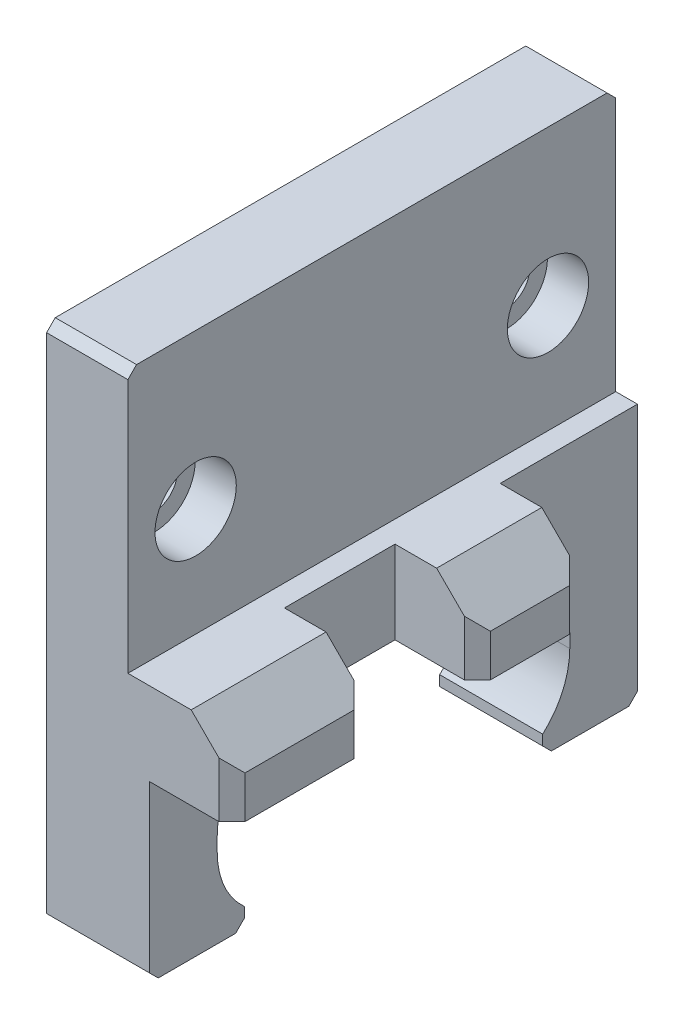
ISO-10303-21;
HEADER;
FILE_DESCRIPTION(('STEP AP214'),'2;1');
FILE_NAME('part.step','',(''),(''),'','','');
FILE_SCHEMA(('AUTOMOTIVE_DESIGN { 1 0 10303 214 1 1 1 1 }'));
ENDSEC;
DATA;
#1=APPLICATION_CONTEXT('core data for automotive mechanical design processes');
#2=APPLICATION_PROTOCOL_DEFINITION('international standard','automotive_design',2000,#1);
#3=PRODUCT_CONTEXT('',#1,'mechanical');
#4=PRODUCT('Part','Part','',(#3));
#5=PRODUCT_RELATED_PRODUCT_CATEGORY('part','',(#4));
#6=PRODUCT_DEFINITION_FORMATION('','',#4);
#7=PRODUCT_DEFINITION_CONTEXT('part definition',#1,'design');
#8=PRODUCT_DEFINITION('design','',#6,#7);
#9=PRODUCT_DEFINITION_SHAPE('','',#8);
#10=(LENGTH_UNIT() NAMED_UNIT(*) SI_UNIT(.MILLI.,.METRE.));
#11=(NAMED_UNIT(*) PLANE_ANGLE_UNIT() SI_UNIT($,.RADIAN.));
#12=(NAMED_UNIT(*) SI_UNIT($,.STERADIAN.) SOLID_ANGLE_UNIT());
#13=UNCERTAINTY_MEASURE_WITH_UNIT(LENGTH_MEASURE(1.E-05),#10,'distance_accuracy_value','');
#14=(GEOMETRIC_REPRESENTATION_CONTEXT(3) GLOBAL_UNCERTAINTY_ASSIGNED_CONTEXT((#13)) GLOBAL_UNIT_ASSIGNED_CONTEXT((#10,
#11,#12)) REPRESENTATION_CONTEXT('',''));
#15=CARTESIAN_POINT('',(0.,0.,0.));
#16=DIRECTION('',(0.,0.,1.));
#17=DIRECTION('',(1.,0.,0.));
#18=AXIS2_PLACEMENT_3D('',#15,#16,#17);
#19=CARTESIAN_POINT('',(4.57199999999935,11.1125000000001,28.5750000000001));
#20=DIRECTION('',(0.,1.00000000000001,0.));
#21=DIRECTION('',(-1.,0.,0.));
#22=AXIS2_PLACEMENT_3D('',#19,#20,#21);
#23=PLANE('',#22);
#24=DIRECTION('',(0.,0.,-1.00000000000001));
#25=VECTOR('',#24,1.);
#26=CARTESIAN_POINT('',(4.57199999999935,11.1125000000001,28.5750000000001));
#27=LINE('',#26,#25);
#28=CARTESIAN_POINT('',(4.57200000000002,11.1125000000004,-1.7018));
#29=VERTEX_POINT('',#28);
#30=CARTESIAN_POINT('',(4.57199999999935,11.1125000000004,-10.9728));
#31=VERTEX_POINT('',#30);
#32=EDGE_CURVE('E465',#29,#31,#27,.T.);
#33=ORIENTED_EDGE('',*,*,#32,.F.);
#34=DIRECTION('',(0.707106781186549,0.,-0.707106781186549));
#35=VECTOR('',#34,1.);
#36=CARTESIAN_POINT('',(4.57200000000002,11.1125000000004,-1.70180000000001));
#37=LINE('',#36,#35);
#38=CARTESIAN_POINT('',(3.048,11.1125000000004,-0.1778));
#39=VERTEX_POINT('',#38);
#40=EDGE_CURVE('E552',#29,#39,#37,.F.);
#41=ORIENTED_EDGE('',*,*,#40,.T.);
#42=DIRECTION('',(1.,0.,0.));
#43=VECTOR('',#42,1.);
#44=CARTESIAN_POINT('',(4.57200000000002,11.1125000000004,-0.177799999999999));
#45=LINE('',#44,#43);
#46=CARTESIAN_POINT('',(-5.08000000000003,11.1125000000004,-0.177800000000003));
#47=VERTEX_POINT('',#46);
#48=EDGE_CURVE('E762',#47,#39,#45,.T.);
#49=ORIENTED_EDGE('',*,*,#48,.F.);
#50=DIRECTION('',(0.,0.,-1.00000000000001));
#51=VECTOR('',#50,1.);
#52=CARTESIAN_POINT('',(-5.08000000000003,11.1125000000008,12.7762000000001));
#53=LINE('',#52,#51);
#54=CARTESIAN_POINT('',(-5.08000000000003,11.1125000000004,11.1252000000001));
#55=VERTEX_POINT('',#54);
#56=EDGE_CURVE('E759',#55,#47,#53,.T.);
#57=ORIENTED_EDGE('',*,*,#56,.F.);
#58=DIRECTION('',(1.,0.,0.));
#59=VECTOR('',#58,1.);
#60=CARTESIAN_POINT('',(-17.145,11.1125000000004,11.1252));
#61=LINE('',#60,#59);
#62=CARTESIAN_POINT('',(-17.145,11.1125000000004,11.1252));
#63=VERTEX_POINT('',#62);
#64=EDGE_CURVE('E644',#63,#55,#61,.T.);
#65=ORIENTED_EDGE('',*,*,#64,.F.);
#66=DIRECTION('',(0.,0.,1.00000000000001));
#67=VECTOR('',#66,1.);
#68=CARTESIAN_POINT('',(-17.145,11.1125000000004,11.1252));
#69=LINE('',#68,#67);
#70=CARTESIAN_POINT('',(-17.1450000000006,11.1125000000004,-11.1252000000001));
#71=VERTEX_POINT('',#70);
#72=EDGE_CURVE('E621',#71,#63,#69,.T.);
#73=ORIENTED_EDGE('',*,*,#72,.F.);
#74=DIRECTION('',(1.,0.,0.));
#75=VECTOR('',#74,1.);
#76=CARTESIAN_POINT('',(-17.1450000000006,11.1125000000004,-11.1252000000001));
#77=LINE('',#76,#75);
#78=CARTESIAN_POINT('',(-5.08000000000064,11.1125000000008,-11.1252));
#79=VERTEX_POINT('',#78);
#80=EDGE_CURVE('E458',#71,#79,#77,.T.);
#81=ORIENTED_EDGE('',*,*,#80,.T.);
#82=DIRECTION('',(0.,0.,-1.00000000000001));
#83=VECTOR('',#82,1.);
#84=CARTESIAN_POINT('',(-5.08000000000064,11.1125000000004,28.5750000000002));
#85=LINE('',#84,#83);
#86=CARTESIAN_POINT('',(-5.08000000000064,11.1125000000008,-12.4968000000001));
#87=VERTEX_POINT('',#86);
#88=EDGE_CURVE('E451',#79,#87,#85,.T.);
#89=ORIENTED_EDGE('',*,*,#88,.T.);
#90=DIRECTION('',(-1.,0.,0.));
#91=VECTOR('',#90,1.);
#92=CARTESIAN_POINT('',(4.57199999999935,11.1125000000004,-12.4968000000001));
#93=LINE('',#92,#91);
#94=CARTESIAN_POINT('',(3.04799999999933,11.1125000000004,-12.4968000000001));
#95=VERTEX_POINT('',#94);
#96=EDGE_CURVE('E433',#95,#87,#93,.T.);
#97=ORIENTED_EDGE('',*,*,#96,.F.);
#98=DIRECTION('',(-0.707106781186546,0.,-0.707106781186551));
#99=VECTOR('',#98,1.);
#100=CARTESIAN_POINT('',(3.04799999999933,11.1125000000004,-12.4968000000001));
#101=LINE('',#100,#99);
#102=EDGE_CURVE('E550',#95,#31,#101,.F.);
#103=ORIENTED_EDGE('',*,*,#102,.T.);
#104=EDGE_LOOP('',(#33,#41,#49,#57,#65,#73,#81,#89,#97,#103));
#105=FACE_BOUND('',#104,.T.);
#106=ADVANCED_FACE('F206',(#105),#23,.F.);
#107=CARTESIAN_POINT('',(4.57199999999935,20.8280000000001,28.5750000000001));
#108=DIRECTION('',(-1.,0.,0.));
#109=DIRECTION('',(0.,-1.00000000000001,0.));
#110=AXIS2_PLACEMENT_3D('',#107,#108,#109);
#111=PLANE('',#110);
#112=DIRECTION('',(0.,1.00000000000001,0.));
#113=VECTOR('',#112,1.);
#114=CARTESIAN_POINT('',(4.57199999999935,20.8280000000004,-10.9728));
#115=LINE('',#114,#113);
#116=CARTESIAN_POINT('',(4.57199999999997,16.0528000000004,-10.9728));
#117=VERTEX_POINT('',#116);
#118=EDGE_CURVE('E546',#31,#117,#115,.T.);
#119=ORIENTED_EDGE('',*,*,#118,.T.);
#120=DIRECTION('',(0.,0.,1.00000000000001));
#121=VECTOR('',#120,1.);
#122=CARTESIAN_POINT('',(4.57199999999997,16.0528000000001,28.5750000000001));
#123=LINE('',#122,#121);
#124=CARTESIAN_POINT('',(4.57200000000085,16.0528000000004,-1.70180000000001));
#125=VERTEX_POINT('',#124);
#126=EDGE_CURVE('E228',#117,#125,#123,.T.);
#127=ORIENTED_EDGE('',*,*,#126,.T.);
#128=DIRECTION('',(0.,-1.00000000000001,0.));
#129=VECTOR('',#128,1.);
#130=CARTESIAN_POINT('',(4.57199999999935,20.8280000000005,-1.70180000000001));
#131=LINE('',#130,#129);
#132=EDGE_CURVE('E548',#125,#29,#131,.T.);
#133=ORIENTED_EDGE('',*,*,#132,.T.);
#134=ORIENTED_EDGE('',*,*,#32,.T.);
#135=EDGE_LOOP('',(#119,#127,#133,#134));
#136=FACE_BOUND('',#135,.T.);
#137=ADVANCED_FACE('F583',(#136),#111,.F.);
#138=CARTESIAN_POINT('',(-5.07999999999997,-9.3217999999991,28.5750000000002));
#139=DIRECTION('',(0.,1.00000000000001,0.));
#140=DIRECTION('',(-1.,0.,0.));
#141=AXIS2_PLACEMENT_3D('',#138,#139,#140);
#142=PLANE('',#141);
#143=DIRECTION('',(0.,0.,-1.00000000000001));
#144=VECTOR('',#143,1.);
#145=CARTESIAN_POINT('',(-17.145,-9.3217999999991,28.5750000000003));
#146=LINE('',#145,#144);
#147=CARTESIAN_POINT('',(-17.145,-9.32180000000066,27.5590000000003));
#148=VERTEX_POINT('',#147);
#149=CARTESIAN_POINT('',(-17.1450000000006,-9.32179999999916,18.4912000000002));
#150=VERTEX_POINT('',#149);
#151=EDGE_CURVE('E703',#148,#150,#146,.T.);
#152=ORIENTED_EDGE('',*,*,#151,.T.);
#153=DIRECTION('',(1.,0.,0.));
#154=VECTOR('',#153,1.);
#155=CARTESIAN_POINT('',(-5.08000000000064,-9.32179999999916,18.4912000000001));
#156=LINE('',#155,#154);
#157=CARTESIAN_POINT('',(-5.08000000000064,-9.32179999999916,18.4912000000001));
#158=VERTEX_POINT('',#157);
#159=EDGE_CURVE('E504',#150,#158,#156,.T.);
#160=ORIENTED_EDGE('',*,*,#159,.T.);
#161=DIRECTION('',(0.,0.,-1.00000000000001));
#162=VECTOR('',#161,1.);
#163=CARTESIAN_POINT('',(-5.07999999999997,-9.3217999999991,28.5750000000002));
#164=LINE('',#163,#162);
#165=CARTESIAN_POINT('',(-5.07999999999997,-9.32180000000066,27.5590000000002));
#166=VERTEX_POINT('',#165);
#167=EDGE_CURVE('E470',#166,#158,#164,.T.);
#168=ORIENTED_EDGE('',*,*,#167,.F.);
#169=DIRECTION('',(-1.,0.,0.));
#170=VECTOR('',#169,1.);
#171=CARTESIAN_POINT('',(-17.145,-9.32180000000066,27.5590000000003));
#172=LINE('',#171,#170);
#173=EDGE_CURVE('E502',#166,#148,#172,.T.);
#174=ORIENTED_EDGE('',*,*,#173,.T.);
#175=EDGE_LOOP('',(#152,#160,#168,#174));
#176=FACE_BOUND('',#175,.T.);
#177=ADVANCED_FACE('F786',(#176),#142,.F.);
#178=CARTESIAN_POINT('',(-5.08000000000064,11.1125000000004,28.5750000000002));
#179=DIRECTION('',(-1.,0.,0.));
#180=DIRECTION('',(0.,-1.00000000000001,0.));
#181=AXIS2_PLACEMENT_3D('',#178,#179,#180);
#182=PLANE('',#181);
#183=ORIENTED_EDGE('',*,*,#167,.T.);
#184=DIRECTION('',(0.,-0.707106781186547,0.707106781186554));
#185=VECTOR('',#184,1.);
#186=CARTESIAN_POINT('',(-5.08000000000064,-9.32179999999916,18.4912000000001));
#187=LINE('',#186,#185);
#188=CARTESIAN_POINT('',(-5.08000000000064,-8.30579999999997,17.4752000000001));
#189=VERTEX_POINT('',#188);
#190=EDGE_CURVE('E509',#158,#189,#187,.F.);
#191=ORIENTED_EDGE('',*,*,#190,.T.);
#192=DIRECTION('',(0.,1.00000000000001,0.));
#193=VECTOR('',#192,1.);
#194=CARTESIAN_POINT('',(-5.07999999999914,11.1125000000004,17.4752000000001));
#195=LINE('',#194,#193);
#196=CARTESIAN_POINT('',(-5.07999999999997,-7.09951582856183,17.4752));
#197=VERTEX_POINT('',#196);
#198=EDGE_CURVE('E675',#189,#197,#195,.T.);
#199=ORIENTED_EDGE('',*,*,#198,.T.);
#200=CARTESIAN_POINT('',(-5.08000000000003,-6.66133814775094E-13,11.1252000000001));
#201=DIRECTION('',(-1.,0.,0.));
#202=DIRECTION('',(0.,-1.00000000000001,0.));
#203=AXIS2_PLACEMENT_3D('',#200,#201,#202);
#204=CIRCLE('',#203,9.525);
#205=CARTESIAN_POINT('',(-5.08000000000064,8.88178419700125E-13,20.6502000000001));
#206=VERTEX_POINT('',#205);
#207=EDGE_CURVE('E672',#197,#206,#204,.T.);
#208=ORIENTED_EDGE('',*,*,#207,.T.);
#209=DIRECTION('',(0.,1.00000000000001,0.));
#210=VECTOR('',#209,1.);
#211=CARTESIAN_POINT('',(-5.08000000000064,11.1125000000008,20.6502000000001));
#212=LINE('',#211,#210);
#213=CARTESIAN_POINT('',(-5.08000000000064,1.58750000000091,20.6502000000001));
#214=VERTEX_POINT('',#213);
#215=EDGE_CURVE('E669',#206,#214,#212,.T.);
#216=ORIENTED_EDGE('',*,*,#215,.T.);
#217=CARTESIAN_POINT('',(-5.07999999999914,1.58749999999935,11.1252));
#218=DIRECTION('',(-1.,0.,0.));
#219=DIRECTION('',(0.,-1.00000000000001,0.));
#220=AXIS2_PLACEMENT_3D('',#217,#218,#219);
#221=CIRCLE('',#220,9.525);
#222=EDGE_CURVE('E666',#214,#55,#221,.T.);
#223=ORIENTED_EDGE('',*,*,#222,.T.);
#224=ORIENTED_EDGE('',*,*,#56,.T.);
#225=DIRECTION('',(0.,-1.00000000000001,0.));
#226=VECTOR('',#225,1.);
#227=CARTESIAN_POINT('',(-5.08000000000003,51.6382000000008,-0.177800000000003));
#228=LINE('',#227,#226);
#229=CARTESIAN_POINT('',(-5.07999999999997,20.8280000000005,-0.177800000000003));
#230=VERTEX_POINT('',#229);
#231=EDGE_CURVE('E602',#230,#47,#228,.T.);
#232=ORIENTED_EDGE('',*,*,#231,.F.);
#233=DIRECTION('',(0.,0.,-1.00000000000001));
#234=VECTOR('',#233,1.);
#235=CARTESIAN_POINT('',(-5.08000000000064,20.8280000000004,28.5750000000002));
#236=LINE('',#235,#234);
#237=CARTESIAN_POINT('',(-5.08000000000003,20.8280000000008,12.7762000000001));
#238=VERTEX_POINT('',#237);
#239=EDGE_CURVE('E596',#238,#230,#236,.T.);
#240=ORIENTED_EDGE('',*,*,#239,.F.);
#241=DIRECTION('',(0.,-1.00000000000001,0.));
#242=VECTOR('',#241,1.);
#243=CARTESIAN_POINT('',(-5.08000000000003,51.6382000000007,12.7762000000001));
#244=LINE('',#243,#242);
#245=CARTESIAN_POINT('',(-5.08000000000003,11.1125000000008,12.7762000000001));
#246=VERTEX_POINT('',#245);
#247=EDGE_CURVE('E607',#238,#246,#244,.T.);
#248=ORIENTED_EDGE('',*,*,#247,.T.);
#249=CARTESIAN_POINT('',(-5.08000000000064,11.1125000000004,28.5750000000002));
#250=VERTEX_POINT('',#249);
#251=EDGE_CURVE('E459',#250,#246,#85,.T.);
#252=ORIENTED_EDGE('',*,*,#251,.F.);
#253=DIRECTION('',(0.,1.00000000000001,0.));
#254=VECTOR('',#253,1.);
#255=CARTESIAN_POINT('',(-5.08000000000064,11.1125000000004,28.5750000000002));
#256=LINE('',#255,#254);
#257=CARTESIAN_POINT('',(-5.07999999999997,-8.30579999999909,28.5750000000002));
#258=VERTEX_POINT('',#257);
#259=EDGE_CURVE('E687',#258,#250,#256,.T.);
#260=ORIENTED_EDGE('',*,*,#259,.F.);
#261=DIRECTION('',(0.,-0.707106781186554,-0.707106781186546));
#262=VECTOR('',#261,1.);
#263=CARTESIAN_POINT('',(-5.08000000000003,-8.30579999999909,28.5750000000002));
#264=LINE('',#263,#262);
#265=EDGE_CURVE('E507',#258,#166,#264,.T.);
#266=ORIENTED_EDGE('',*,*,#265,.T.);
#267=EDGE_LOOP('',(#183,#191,#199,#208,#216,#223,#224,#232,#240,#248,#252,#260,#266));
#268=FACE_BOUND('',#267,.T.);
#269=ADVANCED_FACE('F768',(#268),#182,.F.);
#270=CARTESIAN_POINT('',(-17.1450000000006,-9.32180000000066,-18.4912));
#271=VERTEX_POINT('',#270);
#272=CARTESIAN_POINT('',(-17.1449999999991,-9.3217999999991,-27.5590000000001));
#273=VERTEX_POINT('',#272);
#274=EDGE_CURVE('E700',#271,#273,#146,.T.);
#275=ORIENTED_EDGE('',*,*,#274,.T.);
#276=DIRECTION('',(1.,0.,0.));
#277=VECTOR('',#276,1.);
#278=CARTESIAN_POINT('',(-5.07999999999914,-9.3217999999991,-27.5590000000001));
#279=LINE('',#278,#277);
#280=CARTESIAN_POINT('',(-5.07999999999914,-9.3217999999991,-27.5590000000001));
#281=VERTEX_POINT('',#280);
#282=EDGE_CURVE('E515',#273,#281,#279,.T.);
#283=ORIENTED_EDGE('',*,*,#282,.T.);
#284=CARTESIAN_POINT('',(-5.08000000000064,-9.32180000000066,-18.4912));
#285=VERTEX_POINT('',#284);
#286=EDGE_CURVE('E463',#285,#281,#164,.T.);
#287=ORIENTED_EDGE('',*,*,#286,.F.);
#288=DIRECTION('',(-1.,0.,0.));
#289=VECTOR('',#288,1.);
#290=CARTESIAN_POINT('',(-5.08000000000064,-9.32180000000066,-18.4912));
#291=LINE('',#290,#289);
#292=EDGE_CURVE('E513',#285,#271,#291,.T.);
#293=ORIENTED_EDGE('',*,*,#292,.T.);
#294=EDGE_LOOP('',(#275,#283,#287,#293));
#295=FACE_BOUND('',#294,.T.);
#296=ADVANCED_FACE('F208',(#295),#142,.F.);
#297=ORIENTED_EDGE('',*,*,#286,.T.);
#298=DIRECTION('',(0.,-0.707106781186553,0.707106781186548));
#299=VECTOR('',#298,1.);
#300=CARTESIAN_POINT('',(-5.07999999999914,-9.3217999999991,-27.5590000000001));
#301=LINE('',#300,#299);
#302=CARTESIAN_POINT('',(-5.08000000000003,-8.30580000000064,-28.5750000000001));
#303=VERTEX_POINT('',#302);
#304=EDGE_CURVE('E520',#281,#303,#301,.F.);
#305=ORIENTED_EDGE('',*,*,#304,.T.);
#306=DIRECTION('',(0.,1.00000000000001,0.));
#307=VECTOR('',#306,1.);
#308=CARTESIAN_POINT('',(-5.08000000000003,11.1125000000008,-28.5750000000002));
#309=LINE('',#308,#307);
#310=CARTESIAN_POINT('',(-5.08000000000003,20.8280000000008,-28.5750000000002));
#311=VERTEX_POINT('',#310);
#312=EDGE_CURVE('E677',#303,#311,#309,.T.);
#313=ORIENTED_EDGE('',*,*,#312,.T.);
#314=DIRECTION('',(0.,0.,-1.00000000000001));
#315=VECTOR('',#314,1.);
#316=CARTESIAN_POINT('',(-5.08000000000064,20.8280000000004,28.5750000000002));
#317=LINE('',#316,#315);
#318=CARTESIAN_POINT('',(-5.07999999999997,20.8280000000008,-12.4968000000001));
#319=VERTEX_POINT('',#318);
#320=EDGE_CURVE('E453',#319,#311,#317,.T.);
#321=ORIENTED_EDGE('',*,*,#320,.F.);
#322=DIRECTION('',(0.,-1.00000000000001,0.));
#323=VECTOR('',#322,1.);
#324=CARTESIAN_POINT('',(-5.08000000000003,51.6382000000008,-12.4968000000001));
#325=LINE('',#324,#323);
#326=EDGE_CURVE('E437',#319,#87,#325,.T.);
#327=ORIENTED_EDGE('',*,*,#326,.T.);
#328=ORIENTED_EDGE('',*,*,#88,.F.);
#329=CARTESIAN_POINT('',(-5.07999999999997,1.58750000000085,-11.1252));
#330=DIRECTION('',(-1.,0.,0.));
#331=DIRECTION('',(0.,-1.00000000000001,0.));
#332=AXIS2_PLACEMENT_3D('',#329,#330,#331);
#333=CIRCLE('',#332,9.525);
#334=CARTESIAN_POINT('',(-5.08000000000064,1.58749999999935,-20.6502000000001));
#335=VERTEX_POINT('',#334);
#336=EDGE_CURVE('E664',#79,#335,#333,.T.);
#337=ORIENTED_EDGE('',*,*,#336,.T.);
#338=DIRECTION('',(0.,-1.00000000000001,0.));
#339=VECTOR('',#338,1.);
#340=CARTESIAN_POINT('',(-5.07999999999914,11.1125000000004,-20.6502000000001));
#341=LINE('',#340,#339);
#342=CARTESIAN_POINT('',(-5.07999999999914,-6.66133814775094E-13,-20.6502000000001));
#343=VERTEX_POINT('',#342);
#344=EDGE_CURVE('E661',#335,#343,#341,.T.);
#345=ORIENTED_EDGE('',*,*,#344,.T.);
#346=CARTESIAN_POINT('',(-5.08000000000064,8.88178419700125E-13,-11.1252));
#347=DIRECTION('',(-1.,0.,0.));
#348=DIRECTION('',(0.,-1.00000000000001,0.));
#349=AXIS2_PLACEMENT_3D('',#346,#347,#348);
#350=CIRCLE('',#349,9.525);
#351=CARTESIAN_POINT('',(-5.07999999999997,-7.09951582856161,-17.4752000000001));
#352=VERTEX_POINT('',#351);
#353=EDGE_CURVE('E658',#343,#352,#350,.T.);
#354=ORIENTED_EDGE('',*,*,#353,.T.);
#355=DIRECTION('',(0.,-1.00000000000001,0.));
#356=VECTOR('',#355,1.);
#357=CARTESIAN_POINT('',(-5.08000000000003,11.1125000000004,-17.4752000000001));
#358=LINE('',#357,#356);
#359=CARTESIAN_POINT('',(-5.07999999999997,-8.30579999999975,-17.4752));
#360=VERTEX_POINT('',#359);
#361=EDGE_CURVE('E637',#352,#360,#358,.T.);
#362=ORIENTED_EDGE('',*,*,#361,.T.);
#363=DIRECTION('',(0.,0.707106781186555,0.707106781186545));
#364=VECTOR('',#363,1.);
#365=CARTESIAN_POINT('',(-5.07999999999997,-8.30579999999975,-17.4752));
#366=LINE('',#365,#364);
#367=EDGE_CURVE('E518',#360,#285,#366,.F.);
#368=ORIENTED_EDGE('',*,*,#367,.T.);
#369=EDGE_LOOP('',(#297,#305,#313,#321,#327,#328,#337,#345,#354,#362,#368));
#370=FACE_BOUND('',#369,.T.);
#371=ADVANCED_FACE('F449',(#370),#182,.F.);
#372=CARTESIAN_POINT('',(4.57199999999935,11.1125000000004,27.0510000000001));
#373=VERTEX_POINT('',#372);
#374=CARTESIAN_POINT('',(4.57199999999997,11.1125000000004,14.3002000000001));
#375=VERTEX_POINT('',#374);
#376=EDGE_CURVE('E460',#373,#375,#27,.T.);
#377=ORIENTED_EDGE('',*,*,#376,.F.);
#378=DIRECTION('',(-0.707106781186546,0.,0.707106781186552));
#379=VECTOR('',#378,1.);
#380=CARTESIAN_POINT('',(3.04799999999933,11.1124999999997,28.5750000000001));
#381=LINE('',#380,#379);
#382=CARTESIAN_POINT('',(3.04799999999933,11.1124999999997,28.5750000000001));
#383=VERTEX_POINT('',#382);
#384=EDGE_CURVE('E542',#373,#383,#381,.T.);
#385=ORIENTED_EDGE('',*,*,#384,.T.);
#386=DIRECTION('',(1.,0.,0.));
#387=VECTOR('',#386,1.);
#388=CARTESIAN_POINT('',(4.57199999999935,11.1125000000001,28.5750000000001));
#389=LINE('',#388,#387);
#390=EDGE_CURVE('E689',#250,#383,#389,.T.);
#391=ORIENTED_EDGE('',*,*,#390,.F.);
#392=ORIENTED_EDGE('',*,*,#251,.T.);
#393=DIRECTION('',(-1.,0.,0.));
#394=VECTOR('',#393,1.);
#395=CARTESIAN_POINT('',(4.57199999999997,11.1125,12.7762000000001));
#396=LINE('',#395,#394);
#397=CARTESIAN_POINT('',(3.048,11.1125,12.7762000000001));
#398=VERTEX_POINT('',#397);
#399=EDGE_CURVE('E755',#398,#246,#396,.T.);
#400=ORIENTED_EDGE('',*,*,#399,.F.);
#401=DIRECTION('',(-0.707106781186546,0.,-0.707106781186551));
#402=VECTOR('',#401,1.);
#403=CARTESIAN_POINT('',(3.048,11.1125,12.7762000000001));
#404=LINE('',#403,#402);
#405=EDGE_CURVE('E540',#398,#375,#404,.F.);
#406=ORIENTED_EDGE('',*,*,#405,.T.);
#407=EDGE_LOOP('',(#377,#385,#391,#392,#400,#406));
#408=FACE_BOUND('',#407,.T.);
#409=ADVANCED_FACE('F756',(#408),#23,.F.);
#410=DIRECTION('',(0.,1.00000000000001,0.));
#411=VECTOR('',#410,1.);
#412=CARTESIAN_POINT('',(4.57199999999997,20.8280000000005,14.3002000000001));
#413=LINE('',#412,#411);
#414=CARTESIAN_POINT('',(4.57199999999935,16.0528000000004,14.3002000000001));
#415=VERTEX_POINT('',#414);
#416=EDGE_CURVE('E535',#375,#415,#413,.T.);
#417=ORIENTED_EDGE('',*,*,#416,.T.);
#418=DIRECTION('',(0.,0.,1.00000000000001));
#419=VECTOR('',#418,1.);
#420=CARTESIAN_POINT('',(4.57199999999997,16.0528000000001,28.5750000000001));
#421=LINE('',#420,#419);
#422=CARTESIAN_POINT('',(4.57199999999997,16.0528000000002,27.0510000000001));
#423=VERTEX_POINT('',#422);
#424=EDGE_CURVE('E567',#415,#423,#421,.T.);
#425=ORIENTED_EDGE('',*,*,#424,.T.);
#426=DIRECTION('',(0.,-1.00000000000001,0.));
#427=VECTOR('',#426,1.);
#428=CARTESIAN_POINT('',(4.57199999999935,11.1125000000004,27.0510000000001));
#429=LINE('',#428,#427);
#430=EDGE_CURVE('E538',#423,#373,#429,.T.);
#431=ORIENTED_EDGE('',*,*,#430,.T.);
#432=ORIENTED_EDGE('',*,*,#376,.T.);
#433=EDGE_LOOP('',(#417,#425,#431,#432));
#434=FACE_BOUND('',#433,.T.);
#435=ADVANCED_FACE('F776',(#434),#111,.F.);
#436=CARTESIAN_POINT('',(-7.62000000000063,20.8279999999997,28.5750000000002));
#437=DIRECTION('',(0.,-1.00000000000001,0.));
#438=DIRECTION('',(0.,0.,-1.00000000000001));
#439=AXIS2_PLACEMENT_3D('',#436,#437,#438);
#440=PLANE('',#439);
#441=DIRECTION('',(-1.,0.,0.));
#442=VECTOR('',#441,1.);
#443=CARTESIAN_POINT('',(-7.62000000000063,20.8279999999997,28.5750000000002));
#444=LINE('',#443,#442);
#445=CARTESIAN_POINT('',(-0.203200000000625,20.8280000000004,28.5750000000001));
#446=VERTEX_POINT('',#445);
#447=CARTESIAN_POINT('',(-7.62000000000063,20.8279999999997,28.5750000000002));
#448=VERTEX_POINT('',#447);
#449=EDGE_CURVE('E692',#446,#448,#444,.T.);
#450=ORIENTED_EDGE('',*,*,#449,.F.);
#451=DIRECTION('',(0.,0.,-1.00000000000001));
#452=VECTOR('',#451,1.);
#453=CARTESIAN_POINT('',(-0.203200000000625,20.8280000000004,28.5750000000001));
#454=LINE('',#453,#452);
#455=CARTESIAN_POINT('',(-0.203200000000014,20.828,12.7762000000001));
#456=VERTEX_POINT('',#455);
#457=EDGE_CURVE('E560',#446,#456,#454,.T.);
#458=ORIENTED_EDGE('',*,*,#457,.T.);
#459=DIRECTION('',(-1.,0.,0.));
#460=VECTOR('',#459,1.);
#461=CARTESIAN_POINT('',(-7.62000000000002,20.828,12.7762000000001));
#462=LINE('',#461,#460);
#463=EDGE_CURVE('E525',#456,#238,#462,.T.);
#464=ORIENTED_EDGE('',*,*,#463,.T.);
#465=ORIENTED_EDGE('',*,*,#239,.T.);
#466=DIRECTION('',(1.,0.,0.));
#467=VECTOR('',#466,1.);
#468=CARTESIAN_POINT('',(-7.61999999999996,20.8280000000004,-0.177800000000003));
#469=LINE('',#468,#467);
#470=CARTESIAN_POINT('',(-0.203200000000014,20.8280000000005,-0.1778));
#471=VERTEX_POINT('',#470);
#472=EDGE_CURVE('E527',#230,#471,#469,.T.);
#473=ORIENTED_EDGE('',*,*,#472,.T.);
#474=DIRECTION('',(0.,0.,-1.00000000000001));
#475=VECTOR('',#474,1.);
#476=CARTESIAN_POINT('',(-0.203200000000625,20.8280000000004,28.5750000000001));
#477=LINE('',#476,#475);
#478=CARTESIAN_POINT('',(-0.203199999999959,20.8280000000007,-12.4968000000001));
#479=VERTEX_POINT('',#478);
#480=EDGE_CURVE('E557',#471,#479,#477,.T.);
#481=ORIENTED_EDGE('',*,*,#480,.T.);
#482=DIRECTION('',(-1.,0.,0.));
#483=VECTOR('',#482,1.);
#484=CARTESIAN_POINT('',(-7.61999999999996,20.8280000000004,-12.4968000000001));
#485=LINE('',#484,#483);
#486=EDGE_CURVE('E530',#479,#319,#485,.T.);
#487=ORIENTED_EDGE('',*,*,#486,.T.);
#488=ORIENTED_EDGE('',*,*,#320,.T.);
#489=DIRECTION('',(-1.,0.,0.));
#490=VECTOR('',#489,1.);
#491=CARTESIAN_POINT('',(-7.62000000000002,20.8280000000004,-28.5750000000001));
#492=LINE('',#491,#490);
#493=CARTESIAN_POINT('',(-7.62000000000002,20.8280000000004,-28.5750000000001));
#494=VERTEX_POINT('',#493);
#495=EDGE_CURVE('E679',#311,#494,#492,.T.);
#496=ORIENTED_EDGE('',*,*,#495,.T.);
#497=DIRECTION('',(0.,0.,-1.00000000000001));
#498=VECTOR('',#497,1.);
#499=CARTESIAN_POINT('',(-7.62000000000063,20.8279999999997,28.5750000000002));
#500=LINE('',#499,#498);
#501=EDGE_CURVE('E709',#448,#494,#500,.T.);
#502=ORIENTED_EDGE('',*,*,#501,.F.);
#503=EDGE_LOOP('',(#450,#458,#464,#465,#473,#481,#487,#488,#496,#502));
#504=FACE_BOUND('',#503,.T.);
#505=ADVANCED_FACE('F594',(#504),#440,.F.);
#506=CARTESIAN_POINT('',(-7.62000000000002,51.6382,28.5750000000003));
#507=DIRECTION('',(-1.,0.,0.));
#508=DIRECTION('',(0.,-1.00000000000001,0.));
#509=AXIS2_PLACEMENT_3D('',#506,#507,#508);
#510=PLANE('',#509);
#511=CARTESIAN_POINT('',(-7.61999999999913,33.5280000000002,-20.6375));
#512=DIRECTION('',(1.,0.,0.));
#513=DIRECTION('',(0.,0.,-1.00000000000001));
#514=AXIS2_PLACEMENT_3D('',#511,#512,#513);
#515=CIRCLE('',#514,4.76249999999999);
#516=CARTESIAN_POINT('',(-7.61999999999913,33.5280000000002,-25.4000000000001));
#517=VERTEX_POINT('',#516);
#518=EDGE_CURVE('E906',#517,#517,#515,.T.);
#519=ORIENTED_EDGE('',*,*,#518,.F.);
#520=EDGE_LOOP('',(#519));
#521=FACE_BOUND('',#520,.T.);
#522=CARTESIAN_POINT('',(-7.61999999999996,33.528,20.6375000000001));
#523=DIRECTION('',(1.,0.,0.));
#524=DIRECTION('',(0.,0.,-1.00000000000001));
#525=AXIS2_PLACEMENT_3D('',#522,#523,#524);
#526=CIRCLE('',#525,4.76249999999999);
#527=CARTESIAN_POINT('',(-7.61999999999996,33.528,15.8750000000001));
#528=VERTEX_POINT('',#527);
#529=EDGE_CURVE('E909',#528,#528,#526,.T.);
#530=ORIENTED_EDGE('',*,*,#529,.F.);
#531=EDGE_LOOP('',(#530));
#532=FACE_BOUND('',#531,.T.);
#533=DIRECTION('',(0.,1.00000000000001,0.));
#534=VECTOR('',#533,1.);
#535=CARTESIAN_POINT('',(-7.62000000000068,51.6382000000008,-28.5750000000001));
#536=LINE('',#535,#534);
#537=CARTESIAN_POINT('',(-7.62000000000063,50.6222000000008,-28.5750000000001));
#538=VERTEX_POINT('',#537);
#539=EDGE_CURVE('E681',#494,#538,#536,.T.);
#540=ORIENTED_EDGE('',*,*,#539,.T.);
#541=DIRECTION('',(0.,-0.707106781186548,-0.707106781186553));
#542=VECTOR('',#541,1.);
#543=CARTESIAN_POINT('',(-7.62000000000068,51.6382000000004,-27.5590000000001));
#544=LINE('',#543,#542);
#545=CARTESIAN_POINT('',(-7.62000000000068,51.6382000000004,-27.559));
#546=VERTEX_POINT('',#545);
#547=EDGE_CURVE('E494',#538,#546,#544,.F.);
#548=ORIENTED_EDGE('',*,*,#547,.T.);
#549=DIRECTION('',(0.,0.,-1.00000000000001));
#550=VECTOR('',#549,1.);
#551=CARTESIAN_POINT('',(-7.62000000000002,51.6382,28.5750000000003));
#552=LINE('',#551,#550);
#553=CARTESIAN_POINT('',(-7.62000000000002,51.6382,27.5590000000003));
#554=VERTEX_POINT('',#553);
#555=EDGE_CURVE('E707',#554,#546,#552,.T.);
#556=ORIENTED_EDGE('',*,*,#555,.F.);
#557=DIRECTION('',(0.,-0.707106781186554,0.707106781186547));
#558=VECTOR('',#557,1.);
#559=CARTESIAN_POINT('',(-7.62000000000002,50.6222,28.5750000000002));
#560=LINE('',#559,#558);
#561=CARTESIAN_POINT('',(-7.62000000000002,50.6222,28.5750000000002));
#562=VERTEX_POINT('',#561);
#563=EDGE_CURVE('E492',#554,#562,#560,.T.);
#564=ORIENTED_EDGE('',*,*,#563,.T.);
#565=DIRECTION('',(0.,1.00000000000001,0.));
#566=VECTOR('',#565,1.);
#567=CARTESIAN_POINT('',(-7.62000000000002,51.6382,28.5750000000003));
#568=LINE('',#567,#566);
#569=EDGE_CURVE('E694',#448,#562,#568,.T.);
#570=ORIENTED_EDGE('',*,*,#569,.F.);
#571=ORIENTED_EDGE('',*,*,#501,.T.);
#572=EDGE_LOOP('',(#540,#548,#556,#564,#570,#571));
#573=FACE_BOUND('',#572,.T.);
#574=ADVANCED_FACE('F715',(#521,#532,#573),#510,.F.);
#575=CARTESIAN_POINT('',(-17.145,51.6382000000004,28.5750000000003));
#576=DIRECTION('',(0.,-1.00000000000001,0.));
#577=DIRECTION('',(0.,0.,-1.00000000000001));
#578=AXIS2_PLACEMENT_3D('',#575,#576,#577);
#579=PLANE('',#578);
#580=ORIENTED_EDGE('',*,*,#555,.T.);
#581=DIRECTION('',(-1.,0.,0.));
#582=VECTOR('',#581,1.);
#583=CARTESIAN_POINT('',(-17.1450000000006,51.6382000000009,-27.5590000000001));
#584=LINE('',#583,#582);
#585=CARTESIAN_POINT('',(-17.1450000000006,51.6382000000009,-27.559));
#586=VERTEX_POINT('',#585);
#587=EDGE_CURVE('E473',#546,#586,#584,.T.);
#588=ORIENTED_EDGE('',*,*,#587,.T.);
#589=DIRECTION('',(0.,0.,-1.00000000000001));
#590=VECTOR('',#589,1.);
#591=CARTESIAN_POINT('',(-17.145,51.6382000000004,28.5750000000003));
#592=LINE('',#591,#590);
#593=CARTESIAN_POINT('',(-17.145,51.6382000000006,27.5590000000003));
#594=VERTEX_POINT('',#593);
#595=EDGE_CURVE('E704',#594,#586,#592,.T.);
#596=ORIENTED_EDGE('',*,*,#595,.F.);
#597=DIRECTION('',(1.,0.,0.));
#598=VECTOR('',#597,1.);
#599=CARTESIAN_POINT('',(-7.62000000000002,51.6382,27.5590000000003));
#600=LINE('',#599,#598);
#601=EDGE_CURVE('E471',#594,#554,#600,.T.);
#602=ORIENTED_EDGE('',*,*,#601,.T.);
#603=EDGE_LOOP('',(#580,#588,#596,#602));
#604=FACE_BOUND('',#603,.T.);
#605=ADVANCED_FACE('F729',(#604),#579,.F.);
#606=CARTESIAN_POINT('',(-17.145,-9.3217999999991,28.5750000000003));
#607=DIRECTION('',(1.,0.,0.));
#608=DIRECTION('',(0.,0.,-1.00000000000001));
#609=AXIS2_PLACEMENT_3D('',#606,#607,#608);
#610=PLANE('',#609);
#611=CARTESIAN_POINT('',(-17.1449999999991,33.5280000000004,-20.6375));
#612=DIRECTION('',(1.,0.,0.));
#613=DIRECTION('',(0.,0.,-1.00000000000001));
#614=AXIS2_PLACEMENT_3D('',#611,#612,#613);
#615=CIRCLE('',#614,2.667);
#616=CARTESIAN_POINT('',(-17.1449999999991,33.5280000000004,-23.3045000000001));
#617=VERTEX_POINT('',#616);
#618=EDGE_CURVE('E912',#617,#617,#615,.T.);
#619=ORIENTED_EDGE('',*,*,#618,.T.);
#620=EDGE_LOOP('',(#619));
#621=FACE_BOUND('',#620,.T.);
#622=CARTESIAN_POINT('',(-17.145,33.5280000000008,20.6375000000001));
#623=DIRECTION('',(1.,0.,0.));
#624=DIRECTION('',(0.,0.,-1.00000000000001));
#625=AXIS2_PLACEMENT_3D('',#622,#623,#624);
#626=CIRCLE('',#625,2.667);
#627=CARTESIAN_POINT('',(-17.145,33.5280000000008,17.9705000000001));
#628=VERTEX_POINT('',#627);
#629=EDGE_CURVE('E443',#628,#628,#626,.T.);
#630=ORIENTED_EDGE('',*,*,#629,.T.);
#631=EDGE_LOOP('',(#630));
#632=FACE_BOUND('',#631,.T.);
#633=ORIENTED_EDGE('',*,*,#595,.T.);
#634=DIRECTION('',(0.,0.707106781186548,0.707106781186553));
#635=VECTOR('',#634,1.);
#636=CARTESIAN_POINT('',(-17.1450000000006,51.6382000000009,-27.5590000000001));
#637=LINE('',#636,#635);
#638=CARTESIAN_POINT('',(-17.1450000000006,50.6222000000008,-28.5750000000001));
#639=VERTEX_POINT('',#638);
#640=EDGE_CURVE('E486',#586,#639,#637,.F.);
#641=ORIENTED_EDGE('',*,*,#640,.T.);
#642=DIRECTION('',(0.,-1.00000000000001,0.));
#643=VECTOR('',#642,1.);
#644=CARTESIAN_POINT('',(-17.1449999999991,-9.32180000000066,-28.5750000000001));
#645=LINE('',#644,#643);
#646=CARTESIAN_POINT('',(-17.145,-8.30580000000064,-28.5750000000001));
#647=VERTEX_POINT('',#646);
#648=EDGE_CURVE('E684',#639,#647,#645,.T.);
#649=ORIENTED_EDGE('',*,*,#648,.T.);
#650=DIRECTION('',(0.,0.707106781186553,-0.707106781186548));
#651=VECTOR('',#650,1.);
#652=CARTESIAN_POINT('',(-17.1449999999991,-9.3217999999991,-27.5590000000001));
#653=LINE('',#652,#651);
#654=EDGE_CURVE('E480',#647,#273,#653,.F.);
#655=ORIENTED_EDGE('',*,*,#654,.T.);
#656=ORIENTED_EDGE('',*,*,#274,.F.);
#657=DIRECTION('',(0.,-0.707106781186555,-0.707106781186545));
#658=VECTOR('',#657,1.);
#659=CARTESIAN_POINT('',(-17.145,-8.30579999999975,-17.4752));
#660=LINE('',#659,#658);
#661=CARTESIAN_POINT('',(-17.145,-8.30579999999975,-17.4752));
#662=VERTEX_POINT('',#661);
#663=EDGE_CURVE('E476',#271,#662,#660,.F.);
#664=ORIENTED_EDGE('',*,*,#663,.T.);
#665=DIRECTION('',(0.,1.00000000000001,0.));
#666=VECTOR('',#665,1.);
#667=CARTESIAN_POINT('',(-17.1450000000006,-9.32179999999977,-17.4752));
#668=LINE('',#667,#666);
#669=CARTESIAN_POINT('',(-17.145,-7.09951582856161,-17.4752000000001));
#670=VERTEX_POINT('',#669);
#671=EDGE_CURVE('E605',#662,#670,#668,.T.);
#672=ORIENTED_EDGE('',*,*,#671,.T.);
#673=CARTESIAN_POINT('',(-17.1450000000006,8.88178419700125E-13,-11.1252000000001));
#674=DIRECTION('',(1.,0.,0.));
#675=DIRECTION('',(0.,0.,1.00000000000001));
#676=AXIS2_PLACEMENT_3D('',#673,#674,#675);
#677=CIRCLE('',#676,9.525);
#678=CARTESIAN_POINT('',(-17.1449999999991,-6.66133814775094E-13,-20.6502));
#679=VERTEX_POINT('',#678);
#680=EDGE_CURVE('E612',#670,#679,#677,.T.);
#681=ORIENTED_EDGE('',*,*,#680,.T.);
#682=DIRECTION('',(0.,1.00000000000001,0.));
#683=VECTOR('',#682,1.);
#684=CARTESIAN_POINT('',(-17.1450000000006,1.58749999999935,-20.6502));
#685=LINE('',#684,#683);
#686=CARTESIAN_POINT('',(-17.1450000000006,1.58749999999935,-20.6502));
#687=VERTEX_POINT('',#686);
#688=EDGE_CURVE('E615',#679,#687,#685,.T.);
#689=ORIENTED_EDGE('',*,*,#688,.T.);
#690=CARTESIAN_POINT('',(-17.145,1.58750000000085,-11.1252000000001));
#691=DIRECTION('',(1.,0.,0.));
#692=DIRECTION('',(0.,0.,-1.00000000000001));
#693=AXIS2_PLACEMENT_3D('',#690,#691,#692);
#694=CIRCLE('',#693,9.525);
#695=EDGE_CURVE('E618',#687,#71,#694,.T.);
#696=ORIENTED_EDGE('',*,*,#695,.T.);
#697=ORIENTED_EDGE('',*,*,#72,.T.);
#698=CARTESIAN_POINT('',(-17.1449999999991,1.58749999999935,11.1252));
#699=DIRECTION('',(1.,0.,0.));
#700=DIRECTION('',(0.,0.,1.00000000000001));
#701=AXIS2_PLACEMENT_3D('',#698,#699,#700);
#702=CIRCLE('',#701,9.525);
#703=CARTESIAN_POINT('',(-17.1450000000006,1.58750000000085,20.6502000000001));
#704=VERTEX_POINT('',#703);
#705=EDGE_CURVE('E624',#63,#704,#702,.T.);
#706=ORIENTED_EDGE('',*,*,#705,.T.);
#707=DIRECTION('',(0.,-1.00000000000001,0.));
#708=VECTOR('',#707,1.);
#709=CARTESIAN_POINT('',(-17.1450000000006,1.58750000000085,20.6502000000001));
#710=LINE('',#709,#708);
#711=CARTESIAN_POINT('',(-17.1450000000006,8.88178419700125E-13,20.6502000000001));
#712=VERTEX_POINT('',#711);
#713=EDGE_CURVE('E627',#704,#712,#710,.T.);
#714=ORIENTED_EDGE('',*,*,#713,.T.);
#715=CARTESIAN_POINT('',(-17.145,-6.66133814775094E-13,11.1252));
#716=DIRECTION('',(1.,0.,0.));
#717=DIRECTION('',(0.,0.,-1.00000000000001));
#718=AXIS2_PLACEMENT_3D('',#715,#716,#717);
#719=CIRCLE('',#718,9.525);
#720=CARTESIAN_POINT('',(-17.145,-7.09951582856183,17.4752000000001));
#721=VERTEX_POINT('',#720);
#722=EDGE_CURVE('E630',#712,#721,#719,.T.);
#723=ORIENTED_EDGE('',*,*,#722,.T.);
#724=DIRECTION('',(0.,-1.00000000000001,0.));
#725=VECTOR('',#724,1.);
#726=CARTESIAN_POINT('',(-17.1450000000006,-9.32179999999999,17.4752000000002));
#727=LINE('',#726,#725);
#728=CARTESIAN_POINT('',(-17.1450000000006,-8.30579999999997,17.4752000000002));
#729=VERTEX_POINT('',#728);
#730=EDGE_CURVE('E601',#721,#729,#727,.T.);
#731=ORIENTED_EDGE('',*,*,#730,.T.);
#732=DIRECTION('',(0.,0.707106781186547,-0.707106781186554));
#733=VECTOR('',#732,1.);
#734=CARTESIAN_POINT('',(-17.1450000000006,-9.32179999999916,18.4912000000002));
#735=LINE('',#734,#733);
#736=EDGE_CURVE('E482',#729,#150,#735,.F.);
#737=ORIENTED_EDGE('',*,*,#736,.T.);
#738=ORIENTED_EDGE('',*,*,#151,.F.);
#739=DIRECTION('',(0.,0.707106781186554,0.707106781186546));
#740=VECTOR('',#739,1.);
#741=CARTESIAN_POINT('',(-17.145,-8.30579999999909,28.5750000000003));
#742=LINE('',#741,#740);
#743=CARTESIAN_POINT('',(-17.145,-8.30579999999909,28.5750000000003));
#744=VERTEX_POINT('',#743);
#745=EDGE_CURVE('E478',#148,#744,#742,.T.);
#746=ORIENTED_EDGE('',*,*,#745,.T.);
#747=DIRECTION('',(0.,-1.00000000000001,0.));
#748=VECTOR('',#747,1.);
#749=CARTESIAN_POINT('',(-17.145,-9.3217999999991,28.5750000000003));
#750=LINE('',#749,#748);
#751=CARTESIAN_POINT('',(-17.145,50.6222000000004,28.5750000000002));
#752=VERTEX_POINT('',#751);
#753=EDGE_CURVE('E697',#752,#744,#750,.T.);
#754=ORIENTED_EDGE('',*,*,#753,.F.);
#755=DIRECTION('',(0.,0.707106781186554,-0.707106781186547));
#756=VECTOR('',#755,1.);
#757=CARTESIAN_POINT('',(-17.145,50.6222000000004,28.5750000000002));
#758=LINE('',#757,#756);
#759=EDGE_CURVE('E484',#752,#594,#758,.T.);
#760=ORIENTED_EDGE('',*,*,#759,.T.);
#761=EDGE_LOOP('',(#633,#641,#649,#655,#656,#664,#672,#681,#689,#696,#697,#706,#714,#723,#731,
#737,#738,#746,#754,#760));
#762=FACE_BOUND('',#761,.T.);
#763=ADVANCED_FACE('F893',(#621,#632,#762),#610,.F.);
#764=CARTESIAN_POINT('',(4.57200000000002,-9.32179999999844,28.5750000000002));
#765=DIRECTION('',(0.,0.,1.00000000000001));
#766=DIRECTION('',(1.,0.,0.));
#767=AXIS2_PLACEMENT_3D('',#764,#765,#766);
#768=PLANE('',#767);
#769=DIRECTION('',(0.,1.00000000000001,0.));
#770=VECTOR('',#769,1.);
#771=CARTESIAN_POINT('',(3.04799999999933,20.8279999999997,28.5750000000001));
#772=LINE('',#771,#770);
#773=CARTESIAN_POINT('',(3.048,17.5767999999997,28.5750000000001));
#774=VERTEX_POINT('',#773);
#775=EDGE_CURVE('E532',#383,#774,#772,.T.);
#776=ORIENTED_EDGE('',*,*,#775,.T.);
#777=DIRECTION('',(0.707106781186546,-0.707106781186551,0.));
#778=VECTOR('',#777,1.);
#779=CARTESIAN_POINT('',(17.2593,3.36550000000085,28.5750000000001));
#780=LINE('',#779,#778);
#781=EDGE_CURVE('E571',#774,#446,#780,.F.);
#782=ORIENTED_EDGE('',*,*,#781,.T.);
#783=ORIENTED_EDGE('',*,*,#449,.T.);
#784=ORIENTED_EDGE('',*,*,#569,.T.);
#785=DIRECTION('',(-1.,0.,0.));
#786=VECTOR('',#785,1.);
#787=CARTESIAN_POINT('',(-17.145,50.6222000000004,28.5750000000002));
#788=LINE('',#787,#786);
#789=EDGE_CURVE('E499',#562,#752,#788,.T.);
#790=ORIENTED_EDGE('',*,*,#789,.T.);
#791=ORIENTED_EDGE('',*,*,#753,.T.);
#792=DIRECTION('',(1.,0.,0.));
#793=VECTOR('',#792,1.);
#794=CARTESIAN_POINT('',(-5.07999999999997,-8.30579999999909,28.5750000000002));
#795=LINE('',#794,#793);
#796=EDGE_CURVE('E496',#744,#258,#795,.T.);
#797=ORIENTED_EDGE('',*,*,#796,.T.);
#798=ORIENTED_EDGE('',*,*,#259,.T.);
#799=ORIENTED_EDGE('',*,*,#390,.T.);
#800=EDGE_LOOP('',(#776,#782,#783,#784,#790,#791,#797,#798,#799));
#801=FACE_BOUND('',#800,.T.);
#802=ADVANCED_FACE('F736',(#801),#768,.T.);
#803=CARTESIAN_POINT('',(4.57200000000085,-9.32179999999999,-28.5750000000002));
#804=DIRECTION('',(0.,0.,1.00000000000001));
#805=DIRECTION('',(1.,0.,0.));
#806=AXIS2_PLACEMENT_3D('',#803,#804,#805);
#807=PLANE('',#806);
#808=ORIENTED_EDGE('',*,*,#495,.F.);
#809=ORIENTED_EDGE('',*,*,#312,.F.);
#810=DIRECTION('',(-1.,0.,0.));
#811=VECTOR('',#810,1.);
#812=CARTESIAN_POINT('',(4.57199999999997,-8.30579999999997,-28.5750000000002));
#813=LINE('',#812,#811);
#814=EDGE_CURVE('E488',#303,#647,#813,.T.);
#815=ORIENTED_EDGE('',*,*,#814,.T.);
#816=ORIENTED_EDGE('',*,*,#648,.F.);
#817=DIRECTION('',(1.,0.,0.));
#818=VECTOR('',#817,1.);
#819=CARTESIAN_POINT('',(4.57199999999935,50.6222000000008,-28.5750000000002));
#820=LINE('',#819,#818);
#821=EDGE_CURVE('E490',#639,#538,#820,.T.);
#822=ORIENTED_EDGE('',*,*,#821,.T.);
#823=ORIENTED_EDGE('',*,*,#539,.F.);
#824=EDGE_LOOP('',(#808,#809,#815,#816,#822,#823));
#825=FACE_BOUND('',#824,.T.);
#826=ADVANCED_FACE('F719',(#825),#807,.F.);
#827=CARTESIAN_POINT('',(-17.1450000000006,-9.32179999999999,17.4752000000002));
#828=DIRECTION('',(0.,0.,1.00000000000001));
#829=DIRECTION('',(1.,0.,0.));
#830=AXIS2_PLACEMENT_3D('',#827,#828,#829);
#831=PLANE('',#830);
#832=ORIENTED_EDGE('',*,*,#198,.F.);
#833=DIRECTION('',(-1.,0.,0.));
#834=VECTOR('',#833,1.);
#835=CARTESIAN_POINT('',(-17.1450000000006,-8.30579999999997,17.4752000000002));
#836=LINE('',#835,#834);
#837=EDGE_CURVE('E511',#189,#729,#836,.T.);
#838=ORIENTED_EDGE('',*,*,#837,.T.);
#839=ORIENTED_EDGE('',*,*,#730,.F.);
#840=DIRECTION('',(1.,0.,0.));
#841=VECTOR('',#840,1.);
#842=CARTESIAN_POINT('',(-17.145,-7.09951582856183,17.4752000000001));
#843=LINE('',#842,#841);
#844=EDGE_CURVE('E634',#721,#197,#843,.T.);
#845=ORIENTED_EDGE('',*,*,#844,.T.);
#846=EDGE_LOOP('',(#832,#838,#839,#845));
#847=FACE_BOUND('',#846,.T.);
#848=ADVANCED_FACE('F816',(#847),#831,.F.);
#849=CARTESIAN_POINT('',(-17.145,-6.66133814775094E-13,11.1252));
#850=DIRECTION('',(1.,0.,0.));
#851=DIRECTION('',(0.,0.,-1.00000000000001));
#852=AXIS2_PLACEMENT_3D('',#849,#850,#851);
#853=CYLINDRICAL_SURFACE('',#852,9.525);
#854=ORIENTED_EDGE('',*,*,#844,.F.);
#855=ORIENTED_EDGE('',*,*,#722,.F.);
#856=DIRECTION('',(1.,0.,0.));
#857=VECTOR('',#856,1.);
#858=CARTESIAN_POINT('',(-17.1450000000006,8.88178419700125E-13,20.6502000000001));
#859=LINE('',#858,#857);
#860=EDGE_CURVE('E638',#712,#206,#859,.T.);
#861=ORIENTED_EDGE('',*,*,#860,.T.);
#862=ORIENTED_EDGE('',*,*,#207,.F.);
#863=EDGE_LOOP('',(#854,#855,#861,#862));
#864=FACE_BOUND('',#863,.T.);
#865=ADVANCED_FACE('F820',(#864),#853,.F.);
#866=CARTESIAN_POINT('',(-17.1450000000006,1.58750000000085,20.6502000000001));
#867=DIRECTION('',(0.,0.,1.00000000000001));
#868=DIRECTION('',(1.,0.,0.));
#869=AXIS2_PLACEMENT_3D('',#866,#867,#868);
#870=PLANE('',#869);
#871=ORIENTED_EDGE('',*,*,#860,.F.);
#872=ORIENTED_EDGE('',*,*,#713,.F.);
#873=DIRECTION('',(1.,0.,0.));
#874=VECTOR('',#873,1.);
#875=CARTESIAN_POINT('',(-17.1450000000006,1.58750000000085,20.6502000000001));
#876=LINE('',#875,#874);
#877=EDGE_CURVE('E641',#704,#214,#876,.T.);
#878=ORIENTED_EDGE('',*,*,#877,.T.);
#879=ORIENTED_EDGE('',*,*,#215,.F.);
#880=EDGE_LOOP('',(#871,#872,#878,#879));
#881=FACE_BOUND('',#880,.T.);
#882=ADVANCED_FACE('F822',(#881),#870,.F.);
#883=CARTESIAN_POINT('',(-17.1449999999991,1.58749999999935,11.1252));
#884=DIRECTION('',(1.,0.,0.));
#885=DIRECTION('',(0.,0.,-1.00000000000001));
#886=AXIS2_PLACEMENT_3D('',#883,#884,#885);
#887=CYLINDRICAL_SURFACE('',#886,9.525);
#888=ORIENTED_EDGE('',*,*,#877,.F.);
#889=ORIENTED_EDGE('',*,*,#705,.F.);
#890=ORIENTED_EDGE('',*,*,#64,.T.);
#891=ORIENTED_EDGE('',*,*,#222,.F.);
#892=EDGE_LOOP('',(#888,#889,#890,#891));
#893=FACE_BOUND('',#892,.T.);
#894=ADVANCED_FACE('F826',(#893),#887,.F.);
#895=CARTESIAN_POINT('',(-17.145,1.58750000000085,-11.1252000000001));
#896=DIRECTION('',(1.,0.,0.));
#897=DIRECTION('',(0.,0.,-1.00000000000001));
#898=AXIS2_PLACEMENT_3D('',#895,#896,#897);
#899=CYLINDRICAL_SURFACE('',#898,9.525);
#900=ORIENTED_EDGE('',*,*,#80,.F.);
#901=ORIENTED_EDGE('',*,*,#695,.F.);
#902=DIRECTION('',(1.,0.,0.));
#903=VECTOR('',#902,1.);
#904=CARTESIAN_POINT('',(-17.1450000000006,1.58749999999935,-20.6502));
#905=LINE('',#904,#903);
#906=EDGE_CURVE('E648',#687,#335,#905,.T.);
#907=ORIENTED_EDGE('',*,*,#906,.T.);
#908=ORIENTED_EDGE('',*,*,#336,.F.);
#909=EDGE_LOOP('',(#900,#901,#907,#908));
#910=FACE_BOUND('',#909,.T.);
#911=ADVANCED_FACE('F872',(#910),#899,.F.);
#912=CARTESIAN_POINT('',(-17.1450000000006,1.58749999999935,-20.6502));
#913=DIRECTION('',(0.,0.,-1.00000000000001));
#914=DIRECTION('',(-1.,0.,0.));
#915=AXIS2_PLACEMENT_3D('',#912,#913,#914);
#916=PLANE('',#915);
#917=ORIENTED_EDGE('',*,*,#906,.F.);
#918=ORIENTED_EDGE('',*,*,#688,.F.);
#919=DIRECTION('',(1.,0.,0.));
#920=VECTOR('',#919,1.);
#921=CARTESIAN_POINT('',(-17.1449999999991,-6.66133814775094E-13,-20.6502));
#922=LINE('',#921,#920);
#923=EDGE_CURVE('E651',#679,#343,#922,.T.);
#924=ORIENTED_EDGE('',*,*,#923,.T.);
#925=ORIENTED_EDGE('',*,*,#344,.F.);
#926=EDGE_LOOP('',(#917,#918,#924,#925));
#927=FACE_BOUND('',#926,.T.);
#928=ADVANCED_FACE('F875',(#927),#916,.F.);
#929=CARTESIAN_POINT('',(-17.1450000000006,8.88178419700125E-13,-11.1252000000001));
#930=DIRECTION('',(1.,0.,0.));
#931=DIRECTION('',(0.,0.,-1.00000000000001));
#932=AXIS2_PLACEMENT_3D('',#929,#930,#931);
#933=CYLINDRICAL_SURFACE('',#932,9.525);
#934=ORIENTED_EDGE('',*,*,#923,.F.);
#935=ORIENTED_EDGE('',*,*,#680,.F.);
#936=DIRECTION('',(1.,0.,0.));
#937=VECTOR('',#936,1.);
#938=CARTESIAN_POINT('',(-17.145,-7.09951582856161,-17.4752000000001));
#939=LINE('',#938,#937);
#940=EDGE_CURVE('E633',#670,#352,#939,.T.);
#941=ORIENTED_EDGE('',*,*,#940,.T.);
#942=ORIENTED_EDGE('',*,*,#353,.F.);
#943=EDGE_LOOP('',(#934,#935,#941,#942));
#944=FACE_BOUND('',#943,.T.);
#945=ADVANCED_FACE('F879',(#944),#933,.F.);
#946=CARTESIAN_POINT('',(-17.1450000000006,-9.32179999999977,-17.4752));
#947=DIRECTION('',(0.,0.,-1.00000000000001));
#948=DIRECTION('',(-1.,0.,0.));
#949=AXIS2_PLACEMENT_3D('',#946,#947,#948);
#950=PLANE('',#949);
#951=ORIENTED_EDGE('',*,*,#671,.F.);
#952=DIRECTION('',(1.,0.,0.));
#953=VECTOR('',#952,1.);
#954=CARTESIAN_POINT('',(-17.145,-8.30579999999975,-17.4752));
#955=LINE('',#954,#953);
#956=EDGE_CURVE('E522',#662,#360,#955,.T.);
#957=ORIENTED_EDGE('',*,*,#956,.T.);
#958=ORIENTED_EDGE('',*,*,#361,.F.);
#959=ORIENTED_EDGE('',*,*,#940,.F.);
#960=EDGE_LOOP('',(#951,#957,#958,#959));
#961=FACE_BOUND('',#960,.T.);
#962=ADVANCED_FACE('F865',(#961),#950,.F.);
#963=CARTESIAN_POINT('',(-17.1450000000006,51.6382000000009,-27.5590000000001));
#964=DIRECTION('',(0.,-0.707106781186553,0.707106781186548));
#965=DIRECTION('',(0.,-0.707106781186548,-0.707106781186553));
#966=AXIS2_PLACEMENT_3D('',#963,#964,#965);
#967=PLANE('',#966);
#968=ORIENTED_EDGE('',*,*,#547,.F.);
#969=ORIENTED_EDGE('',*,*,#821,.F.);
#970=ORIENTED_EDGE('',*,*,#640,.F.);
#971=ORIENTED_EDGE('',*,*,#587,.F.);
#972=EDGE_LOOP('',(#968,#969,#970,#971));
#973=FACE_BOUND('',#972,.T.);
#974=ADVANCED_FACE('F724',(#973),#967,.F.);
#975=CARTESIAN_POINT('',(4.57199999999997,50.6222,28.5750000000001));
#976=DIRECTION('',(0.,0.707106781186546,0.707106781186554));
#977=DIRECTION('',(0.,-0.707106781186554,0.707106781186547));
#978=AXIS2_PLACEMENT_3D('',#975,#976,#977);
#979=PLANE('',#978);
#980=ORIENTED_EDGE('',*,*,#563,.F.);
#981=ORIENTED_EDGE('',*,*,#601,.F.);
#982=ORIENTED_EDGE('',*,*,#759,.F.);
#983=ORIENTED_EDGE('',*,*,#789,.F.);
#984=EDGE_LOOP('',(#980,#981,#982,#983));
#985=FACE_BOUND('',#984,.T.);
#986=ADVANCED_FACE('F733',(#985),#979,.T.);
#987=CARTESIAN_POINT('',(-5.08000000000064,-9.32179999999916,18.4912000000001));
#988=DIRECTION('',(0.,0.707106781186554,0.707106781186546));
#989=DIRECTION('',(0.,-0.707106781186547,0.707106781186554));
#990=AXIS2_PLACEMENT_3D('',#987,#988,#989);
#991=PLANE('',#990);
#992=ORIENTED_EDGE('',*,*,#736,.F.);
#993=ORIENTED_EDGE('',*,*,#837,.F.);
#994=ORIENTED_EDGE('',*,*,#190,.F.);
#995=ORIENTED_EDGE('',*,*,#159,.F.);
#996=EDGE_LOOP('',(#992,#993,#994,#995));
#997=FACE_BOUND('',#996,.T.);
#998=ADVANCED_FACE('F811',(#997),#991,.F.);
#999=CARTESIAN_POINT('',(-5.07999999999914,-9.3217999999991,-27.5590000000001));
#1000=DIRECTION('',(0.,0.707106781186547,0.707106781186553));
#1001=DIRECTION('',(0.,-0.707106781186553,0.707106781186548));
#1002=AXIS2_PLACEMENT_3D('',#999,#1000,#1001);
#1003=PLANE('',#1002);
#1004=ORIENTED_EDGE('',*,*,#654,.F.);
#1005=ORIENTED_EDGE('',*,*,#814,.F.);
#1006=ORIENTED_EDGE('',*,*,#304,.F.);
#1007=ORIENTED_EDGE('',*,*,#282,.F.);
#1008=EDGE_LOOP('',(#1004,#1005,#1006,#1007));
#1009=FACE_BOUND('',#1008,.T.);
#1010=ADVANCED_FACE('F854',(#1009),#1003,.F.);
#1011=CARTESIAN_POINT('',(4.57200000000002,-8.30579999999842,28.5750000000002));
#1012=DIRECTION('',(0.,-0.707106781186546,0.707106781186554));
#1013=DIRECTION('',(0.,-0.707106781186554,-0.707106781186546));
#1014=AXIS2_PLACEMENT_3D('',#1011,#1012,#1013);
#1015=PLANE('',#1014);
#1016=ORIENTED_EDGE('',*,*,#745,.F.);
#1017=ORIENTED_EDGE('',*,*,#173,.F.);
#1018=ORIENTED_EDGE('',*,*,#265,.F.);
#1019=ORIENTED_EDGE('',*,*,#796,.F.);
#1020=EDGE_LOOP('',(#1016,#1017,#1018,#1019));
#1021=FACE_BOUND('',#1020,.T.);
#1022=ADVANCED_FACE('F850',(#1021),#1015,.T.);
#1023=CARTESIAN_POINT('',(-17.145,-8.30579999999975,-17.4752));
#1024=DIRECTION('',(0.,0.707106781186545,-0.707106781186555));
#1025=DIRECTION('',(0.,0.707106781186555,0.707106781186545));
#1026=AXIS2_PLACEMENT_3D('',#1023,#1024,#1025);
#1027=PLANE('',#1026);
#1028=ORIENTED_EDGE('',*,*,#663,.F.);
#1029=ORIENTED_EDGE('',*,*,#292,.F.);
#1030=ORIENTED_EDGE('',*,*,#367,.F.);
#1031=ORIENTED_EDGE('',*,*,#956,.F.);
#1032=EDGE_LOOP('',(#1028,#1029,#1030,#1031));
#1033=FACE_BOUND('',#1032,.T.);
#1034=ADVANCED_FACE('F845',(#1033),#1027,.F.);
#1035=CARTESIAN_POINT('',(4.57199999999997,51.6382000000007,-0.177799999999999));
#1036=DIRECTION('',(0.,0.,-1.00000000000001));
#1037=DIRECTION('',(-1.,0.,0.));
#1038=AXIS2_PLACEMENT_3D('',#1035,#1036,#1037);
#1039=PLANE('',#1038);
#1040=DIRECTION('',(0.,1.00000000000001,0.));
#1041=VECTOR('',#1040,1.);
#1042=CARTESIAN_POINT('',(3.048,51.6382000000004,-0.1778));
#1043=LINE('',#1042,#1041);
#1044=CARTESIAN_POINT('',(3.04799999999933,17.5768000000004,-0.177799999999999));
#1045=VERTEX_POINT('',#1044);
#1046=EDGE_CURVE('E554',#39,#1045,#1043,.T.);
#1047=ORIENTED_EDGE('',*,*,#1046,.T.);
#1048=DIRECTION('',(0.707106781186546,-0.707106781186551,0.));
#1049=VECTOR('',#1048,1.);
#1050=CARTESIAN_POINT('',(-0.203200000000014,20.8280000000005,-0.177799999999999));
#1051=LINE('',#1050,#1049);
#1052=EDGE_CURVE('E12',#1045,#471,#1051,.F.);
#1053=ORIENTED_EDGE('',*,*,#1052,.T.);
#1054=ORIENTED_EDGE('',*,*,#472,.F.);
#1055=ORIENTED_EDGE('',*,*,#231,.T.);
#1056=ORIENTED_EDGE('',*,*,#48,.T.);
#1057=EDGE_LOOP('',(#1047,#1053,#1054,#1055,#1056));
#1058=FACE_BOUND('',#1057,.T.);
#1059=ADVANCED_FACE('F588',(#1058),#1039,.F.);
#1060=CARTESIAN_POINT('',(4.57200000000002,51.6382000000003,12.7762000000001));
#1061=DIRECTION('',(0.,0.,1.00000000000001));
#1062=DIRECTION('',(1.,0.,0.));
#1063=AXIS2_PLACEMENT_3D('',#1060,#1061,#1062);
#1064=PLANE('',#1063);
#1065=ORIENTED_EDGE('',*,*,#463,.F.);
#1066=DIRECTION('',(-0.707106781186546,0.707106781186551,0.));
#1067=VECTOR('',#1066,1.);
#1068=CARTESIAN_POINT('',(-0.203200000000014,20.828,12.7762000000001));
#1069=LINE('',#1068,#1067);
#1070=CARTESIAN_POINT('',(3.048,17.5768,12.7762000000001));
#1071=VERTEX_POINT('',#1070);
#1072=EDGE_CURVE('E563',#456,#1071,#1069,.F.);
#1073=ORIENTED_EDGE('',*,*,#1072,.T.);
#1074=DIRECTION('',(0.,-1.00000000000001,0.));
#1075=VECTOR('',#1074,1.);
#1076=CARTESIAN_POINT('',(3.048,51.6382,12.7762000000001));
#1077=LINE('',#1076,#1075);
#1078=EDGE_CURVE('E544',#1071,#398,#1077,.T.);
#1079=ORIENTED_EDGE('',*,*,#1078,.T.);
#1080=ORIENTED_EDGE('',*,*,#399,.T.);
#1081=ORIENTED_EDGE('',*,*,#247,.F.);
#1082=EDGE_LOOP('',(#1065,#1073,#1079,#1080,#1081));
#1083=FACE_BOUND('',#1082,.T.);
#1084=ADVANCED_FACE('F747',(#1083),#1064,.F.);
#1085=CARTESIAN_POINT('',(4.57199999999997,51.6382000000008,-12.4968000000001));
#1086=DIRECTION('',(0.,0.,1.00000000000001));
#1087=DIRECTION('',(1.,0.,0.));
#1088=AXIS2_PLACEMENT_3D('',#1085,#1086,#1087);
#1089=PLANE('',#1088);
#1090=ORIENTED_EDGE('',*,*,#486,.F.);
#1091=DIRECTION('',(-0.707106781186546,0.707106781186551,0.));
#1092=VECTOR('',#1091,1.);
#1093=CARTESIAN_POINT('',(-0.203199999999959,20.8280000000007,-12.4968000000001));
#1094=LINE('',#1093,#1092);
#1095=CARTESIAN_POINT('',(3.048,17.5768000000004,-12.4968000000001));
#1096=VERTEX_POINT('',#1095);
#1097=EDGE_CURVE('E573',#479,#1096,#1094,.F.);
#1098=ORIENTED_EDGE('',*,*,#1097,.T.);
#1099=DIRECTION('',(0.,-1.00000000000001,0.));
#1100=VECTOR('',#1099,1.);
#1101=CARTESIAN_POINT('',(3.048,51.6382000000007,-12.4968000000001));
#1102=LINE('',#1101,#1100);
#1103=EDGE_CURVE('E439',#1096,#95,#1102,.T.);
#1104=ORIENTED_EDGE('',*,*,#1103,.T.);
#1105=ORIENTED_EDGE('',*,*,#96,.T.);
#1106=ORIENTED_EDGE('',*,*,#326,.F.);
#1107=EDGE_LOOP('',(#1090,#1098,#1104,#1105,#1106));
#1108=FACE_BOUND('',#1107,.T.);
#1109=ADVANCED_FACE('F436',(#1108),#1089,.F.);
#1110=CARTESIAN_POINT('',(3.048,-9.32179999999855,28.5750000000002));
#1111=DIRECTION('',(0.707106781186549,0.,0.707106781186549));
#1112=DIRECTION('',(0.707106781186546,0.,-0.707106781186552));
#1113=AXIS2_PLACEMENT_3D('',#1110,#1111,#1112);
#1114=PLANE('',#1113);
#1115=ORIENTED_EDGE('',*,*,#430,.F.);
#1116=DIRECTION('',(0.577350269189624,-0.577350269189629,-0.577350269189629));
#1117=VECTOR('',#1116,1.);
#1118=CARTESIAN_POINT('',(12.0142,8.61060000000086,19.6088));
#1119=LINE('',#1118,#1117);
#1120=EDGE_CURVE('E569',#423,#774,#1119,.F.);
#1121=ORIENTED_EDGE('',*,*,#1120,.T.);
#1122=ORIENTED_EDGE('',*,*,#775,.F.);
#1123=ORIENTED_EDGE('',*,*,#384,.F.);
#1124=EDGE_LOOP('',(#1115,#1121,#1122,#1123));
#1125=FACE_BOUND('',#1124,.T.);
#1126=ADVANCED_FACE('F774',(#1125),#1114,.T.);
#1127=CARTESIAN_POINT('',(3.048,51.6382,12.7762000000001));
#1128=DIRECTION('',(-0.707106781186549,0.,0.707106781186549));
#1129=DIRECTION('',(0.707106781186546,0.,0.707106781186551));
#1130=AXIS2_PLACEMENT_3D('',#1127,#1128,#1129);
#1131=PLANE('',#1130);
#1132=ORIENTED_EDGE('',*,*,#1078,.F.);
#1133=DIRECTION('',(0.577350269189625,-0.577350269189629,0.577350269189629));
#1134=VECTOR('',#1133,1.);
#1135=CARTESIAN_POINT('',(-8.30580000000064,28.9306000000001,1.42239999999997));
#1136=LINE('',#1135,#1134);
#1137=EDGE_CURVE('E565',#1071,#415,#1136,.T.);
#1138=ORIENTED_EDGE('',*,*,#1137,.T.);
#1139=ORIENTED_EDGE('',*,*,#416,.F.);
#1140=ORIENTED_EDGE('',*,*,#405,.F.);
#1141=EDGE_LOOP('',(#1132,#1138,#1139,#1140));
#1142=FACE_BOUND('',#1141,.T.);
#1143=ADVANCED_FACE('F750',(#1142),#1131,.F.);
#1144=CARTESIAN_POINT('',(4.57199999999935,20.8280000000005,-1.70180000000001));
#1145=DIRECTION('',(-0.707106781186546,0.,-0.707106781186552));
#1146=DIRECTION('',(-0.707106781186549,0.,0.707106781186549));
#1147=AXIS2_PLACEMENT_3D('',#1144,#1145,#1146);
#1148=PLANE('',#1147);
#1149=ORIENTED_EDGE('',*,*,#132,.F.);
#1150=DIRECTION('',(-0.577350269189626,0.577350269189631,0.577350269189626));
#1151=VECTOR('',#1150,1.);
#1152=CARTESIAN_POINT('',(2.98026666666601,17.6445333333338,-0.110066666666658));
#1153=LINE('',#1152,#1151);
#1154=EDGE_CURVE('E214',#125,#1045,#1153,.T.);
#1155=ORIENTED_EDGE('',*,*,#1154,.T.);
#1156=ORIENTED_EDGE('',*,*,#1046,.F.);
#1157=ORIENTED_EDGE('',*,*,#40,.F.);
#1158=EDGE_LOOP('',(#1149,#1155,#1156,#1157));
#1159=FACE_BOUND('',#1158,.T.);
#1160=ADVANCED_FACE('F828',(#1159),#1148,.F.);
#1161=CARTESIAN_POINT('',(3.048,51.6382000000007,-12.4968000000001));
#1162=DIRECTION('',(-0.707106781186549,0.,0.707106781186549));
#1163=DIRECTION('',(0.707106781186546,0.,0.707106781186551));
#1164=AXIS2_PLACEMENT_3D('',#1161,#1162,#1163);
#1165=PLANE('',#1164);
#1166=ORIENTED_EDGE('',*,*,#1103,.F.);
#1167=DIRECTION('',(0.577350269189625,-0.577350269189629,0.577350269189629));
#1168=VECTOR('',#1167,1.);
#1169=CARTESIAN_POINT('',(-8.30579999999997,28.9306,-23.8506000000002));
#1170=LINE('',#1169,#1168);
#1171=EDGE_CURVE('E575',#1096,#117,#1170,.T.);
#1172=ORIENTED_EDGE('',*,*,#1171,.T.);
#1173=ORIENTED_EDGE('',*,*,#118,.F.);
#1174=ORIENTED_EDGE('',*,*,#102,.F.);
#1175=EDGE_LOOP('',(#1166,#1172,#1173,#1174));
#1176=FACE_BOUND('',#1175,.T.);
#1177=ADVANCED_FACE('F580',(#1176),#1165,.F.);
#1178=CARTESIAN_POINT('',(-0.203200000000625,20.8280000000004,28.5750000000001));
#1179=DIRECTION('',(-0.707106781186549,-0.707106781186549,0.));
#1180=DIRECTION('',(0.707106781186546,-0.707106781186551,0.));
#1181=AXIS2_PLACEMENT_3D('',#1178,#1179,#1180);
#1182=PLANE('',#1181);
#1183=ORIENTED_EDGE('',*,*,#1120,.F.);
#1184=ORIENTED_EDGE('',*,*,#424,.F.);
#1185=ORIENTED_EDGE('',*,*,#1137,.F.);
#1186=ORIENTED_EDGE('',*,*,#1072,.F.);
#1187=ORIENTED_EDGE('',*,*,#457,.F.);
#1188=ORIENTED_EDGE('',*,*,#781,.F.);
#1189=EDGE_LOOP('',(#1183,#1184,#1185,#1186,#1187,#1188));
#1190=FACE_BOUND('',#1189,.T.);
#1191=ADVANCED_FACE('F742',(#1190),#1182,.F.);
#1192=CARTESIAN_POINT('',(-0.203200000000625,20.8280000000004,28.5750000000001));
#1193=DIRECTION('',(-0.707106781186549,-0.707106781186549,0.));
#1194=DIRECTION('',(0.707106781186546,-0.707106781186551,0.));
#1195=AXIS2_PLACEMENT_3D('',#1192,#1193,#1194);
#1196=PLANE('',#1195);
#1197=ORIENTED_EDGE('',*,*,#1154,.F.);
#1198=ORIENTED_EDGE('',*,*,#126,.F.);
#1199=ORIENTED_EDGE('',*,*,#1171,.F.);
#1200=ORIENTED_EDGE('',*,*,#1097,.F.);
#1201=ORIENTED_EDGE('',*,*,#480,.F.);
#1202=ORIENTED_EDGE('',*,*,#1052,.F.);
#1203=EDGE_LOOP('',(#1197,#1198,#1199,#1200,#1201,#1202));
#1204=FACE_BOUND('',#1203,.T.);
#1205=ADVANCED_FACE('F584',(#1204),#1196,.F.);
#1206=CARTESIAN_POINT('',(-7.61999999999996,33.528,20.6375000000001));
#1207=DIRECTION('',(1.,0.,0.));
#1208=DIRECTION('',(0.,0.,-1.00000000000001));
#1209=AXIS2_PLACEMENT_3D('',#1206,#1207,#1208);
#1210=CYLINDRICAL_SURFACE('',#1209,2.667);
#1211=ORIENTED_EDGE('',*,*,#629,.F.);
#1212=EDGE_LOOP('',(#1211));
#1213=FACE_BOUND('',#1212,.T.);
#1214=CARTESIAN_POINT('',(-12.446,33.528,20.6375000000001));
#1215=DIRECTION('',(1.,0.,0.));
#1216=DIRECTION('',(0.,0.,-1.00000000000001));
#1217=AXIS2_PLACEMENT_3D('',#1214,#1215,#1216);
#1218=CIRCLE('',#1217,2.667);
#1219=CARTESIAN_POINT('',(-12.446,33.528,17.9705000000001));
#1220=VERTEX_POINT('',#1219);
#1221=EDGE_CURVE('E915',#1220,#1220,#1218,.T.);
#1222=ORIENTED_EDGE('',*,*,#1221,.T.);
#1223=EDGE_LOOP('',(#1222));
#1224=FACE_BOUND('',#1223,.T.);
#1225=ADVANCED_FACE('F928',(#1213,#1224),#1210,.F.);
#1226=CARTESIAN_POINT('',(-12.4460000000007,36.195,20.6375000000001));
#1227=DIRECTION('',(-1.,0.,0.));
#1228=DIRECTION('',(0.,0.,1.00000000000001));
#1229=AXIS2_PLACEMENT_3D('',#1226,#1227,#1228);
#1230=PLANE('',#1229);
#1231=ORIENTED_EDGE('',*,*,#1221,.F.);
#1232=EDGE_LOOP('',(#1231));
#1233=FACE_BOUND('',#1232,.T.);
#1234=CARTESIAN_POINT('',(-12.446,33.528,20.6375000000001));
#1235=DIRECTION('',(1.,0.,0.));
#1236=DIRECTION('',(0.,0.,-1.00000000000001));
#1237=AXIS2_PLACEMENT_3D('',#1234,#1235,#1236);
#1238=CIRCLE('',#1237,4.7625);
#1239=CARTESIAN_POINT('',(-12.446,33.528,15.8750000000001));
#1240=VERTEX_POINT('',#1239);
#1241=EDGE_CURVE('E911',#1240,#1240,#1238,.T.);
#1242=ORIENTED_EDGE('',*,*,#1241,.T.);
#1243=EDGE_LOOP('',(#1242));
#1244=FACE_BOUND('',#1243,.T.);
#1245=ADVANCED_FACE('F931',(#1233,#1244),#1230,.F.);
#1246=CARTESIAN_POINT('',(-7.61999999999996,33.528,20.6375000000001));
#1247=DIRECTION('',(1.,0.,0.));
#1248=DIRECTION('',(0.,0.,-1.00000000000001));
#1249=AXIS2_PLACEMENT_3D('',#1246,#1247,#1248);
#1250=CYLINDRICAL_SURFACE('',#1249,4.76249999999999);
#1251=ORIENTED_EDGE('',*,*,#1241,.F.);
#1252=EDGE_LOOP('',(#1251));
#1253=FACE_BOUND('',#1252,.T.);
#1254=ORIENTED_EDGE('',*,*,#529,.T.);
#1255=EDGE_LOOP('',(#1254));
#1256=FACE_BOUND('',#1255,.T.);
#1257=ADVANCED_FACE('F937',(#1253,#1256),#1250,.F.);
#1258=CARTESIAN_POINT('',(-7.61999999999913,33.5280000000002,-20.6375));
#1259=DIRECTION('',(1.,0.,0.));
#1260=DIRECTION('',(0.,0.,-1.00000000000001));
#1261=AXIS2_PLACEMENT_3D('',#1258,#1259,#1260);
#1262=CYLINDRICAL_SURFACE('',#1261,2.667);
#1263=ORIENTED_EDGE('',*,*,#618,.F.);
#1264=EDGE_LOOP('',(#1263));
#1265=FACE_BOUND('',#1264,.T.);
#1266=CARTESIAN_POINT('',(-12.4459999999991,33.5280000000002,-20.6375));
#1267=DIRECTION('',(1.,0.,0.));
#1268=DIRECTION('',(0.,0.,-1.00000000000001));
#1269=AXIS2_PLACEMENT_3D('',#1266,#1267,#1268);
#1270=CIRCLE('',#1269,2.667);
#1271=CARTESIAN_POINT('',(-12.4459999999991,33.5280000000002,-23.3045000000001));
#1272=VERTEX_POINT('',#1271);
#1273=EDGE_CURVE('E918',#1272,#1272,#1270,.T.);
#1274=ORIENTED_EDGE('',*,*,#1273,.T.);
#1275=EDGE_LOOP('',(#1274));
#1276=FACE_BOUND('',#1275,.T.);
#1277=ADVANCED_FACE('F942',(#1265,#1276),#1262,.F.);
#1278=CARTESIAN_POINT('',(-12.4460000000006,36.1950000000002,-20.6375));
#1279=DIRECTION('',(-1.,0.,0.));
#1280=DIRECTION('',(0.,0.,1.00000000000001));
#1281=AXIS2_PLACEMENT_3D('',#1278,#1279,#1280);
#1282=PLANE('',#1281);
#1283=ORIENTED_EDGE('',*,*,#1273,.F.);
#1284=EDGE_LOOP('',(#1283));
#1285=FACE_BOUND('',#1284,.T.);
#1286=CARTESIAN_POINT('',(-12.4459999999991,33.5280000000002,-20.6375));
#1287=DIRECTION('',(1.,0.,0.));
#1288=DIRECTION('',(0.,0.,-1.00000000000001));
#1289=AXIS2_PLACEMENT_3D('',#1286,#1287,#1288);
#1290=CIRCLE('',#1289,4.7625);
#1291=CARTESIAN_POINT('',(-12.4459999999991,33.5280000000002,-25.4000000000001));
#1292=VERTEX_POINT('',#1291);
#1293=EDGE_CURVE('E1005',#1292,#1292,#1290,.T.);
#1294=ORIENTED_EDGE('',*,*,#1293,.T.);
#1295=EDGE_LOOP('',(#1294));
#1296=FACE_BOUND('',#1295,.T.);
#1297=ADVANCED_FACE('F947',(#1285,#1296),#1282,.F.);
#1298=CARTESIAN_POINT('',(-7.61999999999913,33.5280000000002,-20.6375));
#1299=DIRECTION('',(1.,0.,0.));
#1300=DIRECTION('',(0.,0.,-1.00000000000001));
#1301=AXIS2_PLACEMENT_3D('',#1298,#1299,#1300);
#1302=CYLINDRICAL_SURFACE('',#1301,4.76249999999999);
#1303=ORIENTED_EDGE('',*,*,#1293,.F.);
#1304=EDGE_LOOP('',(#1303));
#1305=FACE_BOUND('',#1304,.T.);
#1306=ORIENTED_EDGE('',*,*,#518,.T.);
#1307=EDGE_LOOP('',(#1306));
#1308=FACE_BOUND('',#1307,.T.);
#1309=ADVANCED_FACE('F989',(#1305,#1308),#1302,.F.);
#1310=CLOSED_SHELL('',(#106,#137,#177,#269,#296,#371,#409,#435,#505,#574,#605,#763,#802,#826,
#848,#865,#882,#894,#911,#928,#945,#962,#974,#986,#998,#1010,#1022,#1034,#1059,#1084,#1109,
#1126,#1143,#1160,#1177,#1191,#1205,#1225,#1245,#1257,#1277,#1297,#1309));
#1311=MANIFOLD_SOLID_BREP('B2',#1310);
#1312=ADVANCED_BREP_SHAPE_REPRESENTATION('',(#18,#1311),#14);
#1313=SHAPE_DEFINITION_REPRESENTATION(#9,#1312);
ENDSEC;
END-ISO-10303-21;
